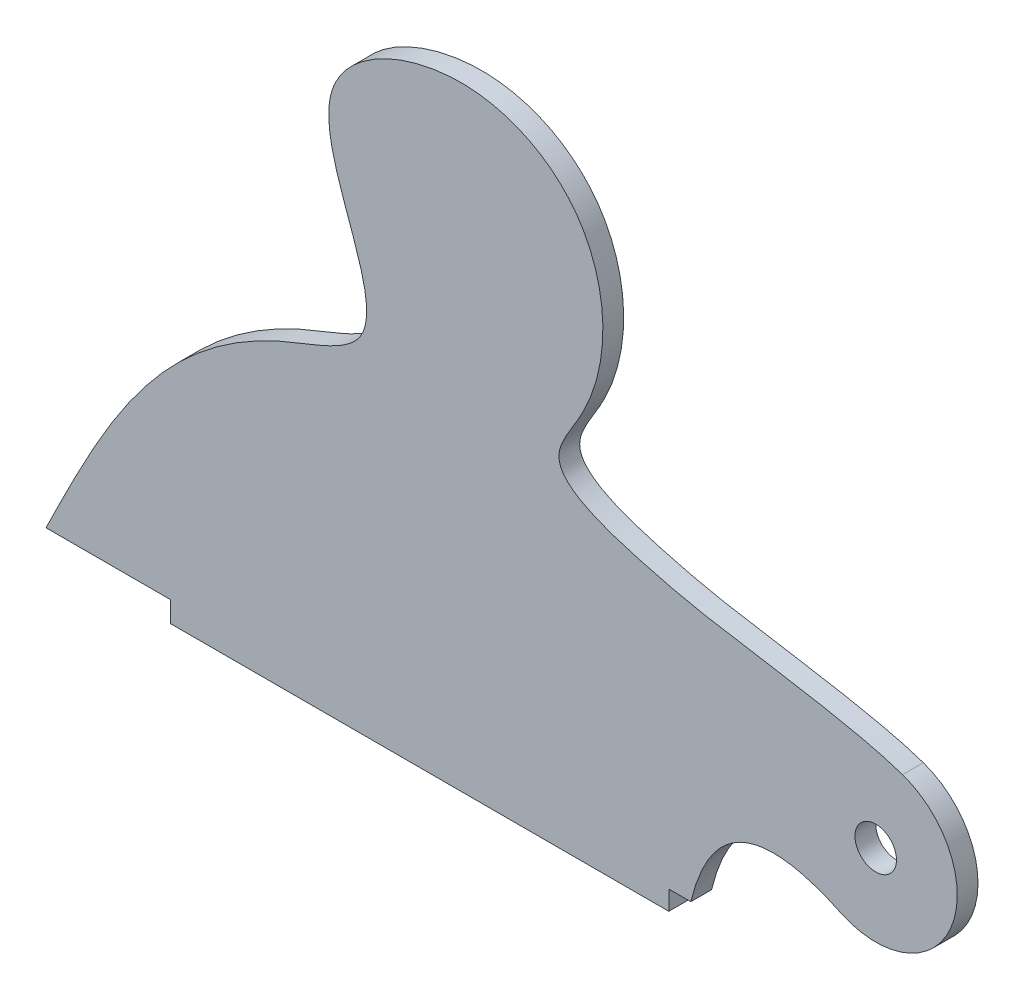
from build123d import *

# Parameters (mm, degrees)
SKETCH1_R           = 3.175
BOSS_EXTRUDE1_DEPTH = 3.175


with BuildPart() as part:
    # Sketch1 → Boss-Extrude1 (new body)
    with BuildSketch(Plane.XY):
        with BuildLine():
            Line((0, -35.216674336), (0, -38.171717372))
            Line((0, -38.171717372), (-76.2, -38.171717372))
            Line((-76.2, -38.171717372), (-76.2, -34.996717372))
            Line((-76.2, -34.996717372), (-95.25, -34.996717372))
            add(Edge.make_bspline(
                [(-95.25, -34.996717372), (-86.374519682, -16.925781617), (-76.461284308, 3.27191886), (-37.744417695, 14.687316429), (-62.623390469, 45.416373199), (-32.365807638, 59.393945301), (-9.403479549, 48.296946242), (-8.378932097, 26.552466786), (-20.415836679, 11.027083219), (-0.402222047, 4.629579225), (10.61923677, 2.967431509), (30.417483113, -0.326567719), (35.76044987, -2.194737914)],
                knots=[0, 0, 0, 0, 0.214841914, 0.264037, 0.377829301, 0.464274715, 0.535465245, 0.63701728, 0.666025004, 0.720815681, 0.792706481, 0.855844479, 0.855844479, 0.855844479, 0.855844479], degree=3))
            ThreePointArc((35.76044987, -2.194737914), (43.194404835, -18.666879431), (26.37003281, -25.265033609))
            add(Edge.make_bspline(
                [(3.368646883, -35.216674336), (7.917216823, -16.442741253), (26.37003281, -25.265033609)],
                knots=[0, 0, 0, 1, 1, 1], degree=2))
            Line((3.368646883, -35.216674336), (0, -35.216674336))
        make_face()
        with Locations((31.644711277, -13.965750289)):
            Circle(SKETCH1_R, mode=Mode.SUBTRACT)
    extrude(amount=BOSS_EXTRUDE1_DEPTH)


solid = part.part
